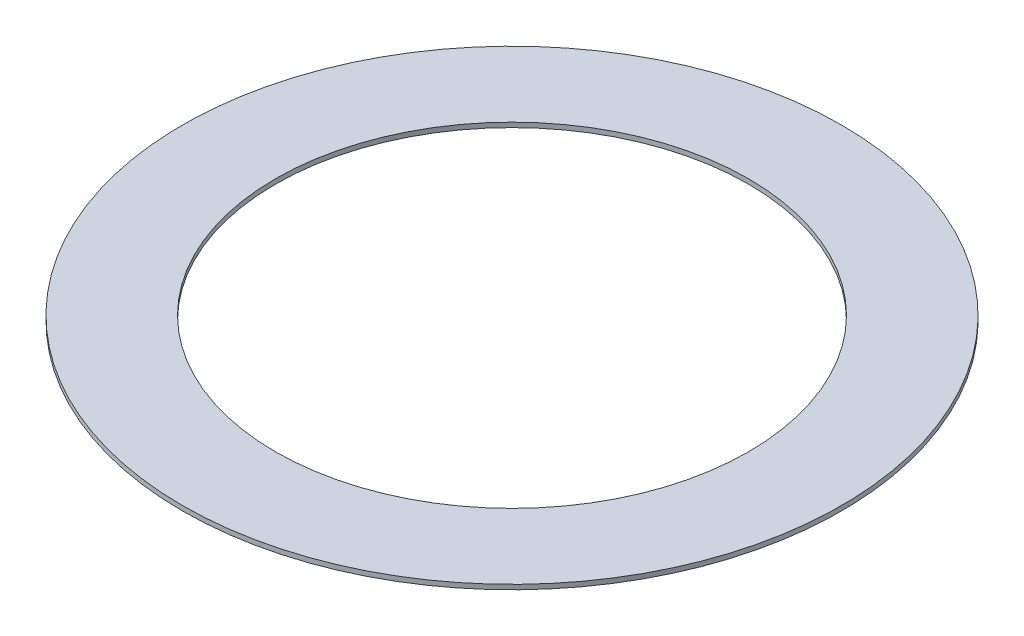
from build123d import *

# Parameters (mm, degrees)
SKETCH1_R      = 10.45
SKETCH1_R_2    = 7.5
EXTRUDE1_DEPTH = 0.15


with BuildPart() as part:
    # Sketch1 → Extrude1 (new body)
    with BuildSketch(Plane(origin=(0, 0, 0), x_dir=(1, 0, 0), z_dir=(0, 1, 0))):
        with Locations(Location((0, 0, 0), (0, 0, 270))):
            Circle(SKETCH1_R)
        with Locations(Location((0, 0, 0), (0, 0, 270))):
            Circle(SKETCH1_R_2, mode=Mode.SUBTRACT)
    extrude(amount=EXTRUDE1_DEPTH)


solid = part.part
